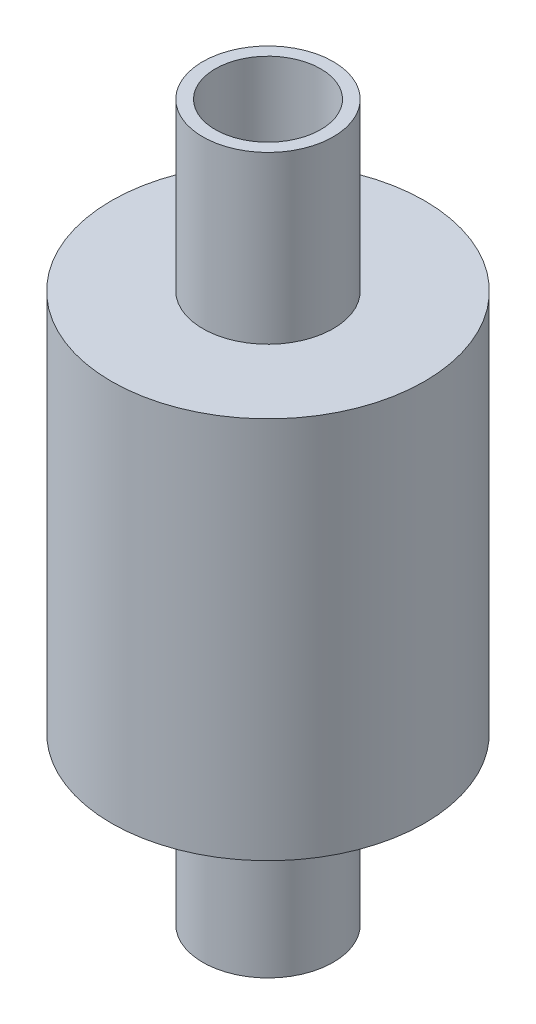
from build123d import *


with BuildPart() as part:
    # Sketch1 → Revolve1 (revolve)
    with BuildSketch(Plane.XY, mode=Mode.PRIVATE) as revolve1_sk:
        Polygon((-3.8481, 0), (-3.8481, 52.197), (-4.7625, 52.197), (-4.7625, 40.0685), (-11.43, 40.0685), (-11.43, 12.1285), (-4.7625, 12.1285), (-4.7625, 0), align=None)
    revolve(revolve1_sk.sketch.rotate(Axis((0, 0, 0), (0, 1, 0)), 270), axis=Axis((0, 0, 0), (0, 1, 0)))


solid = part.part
